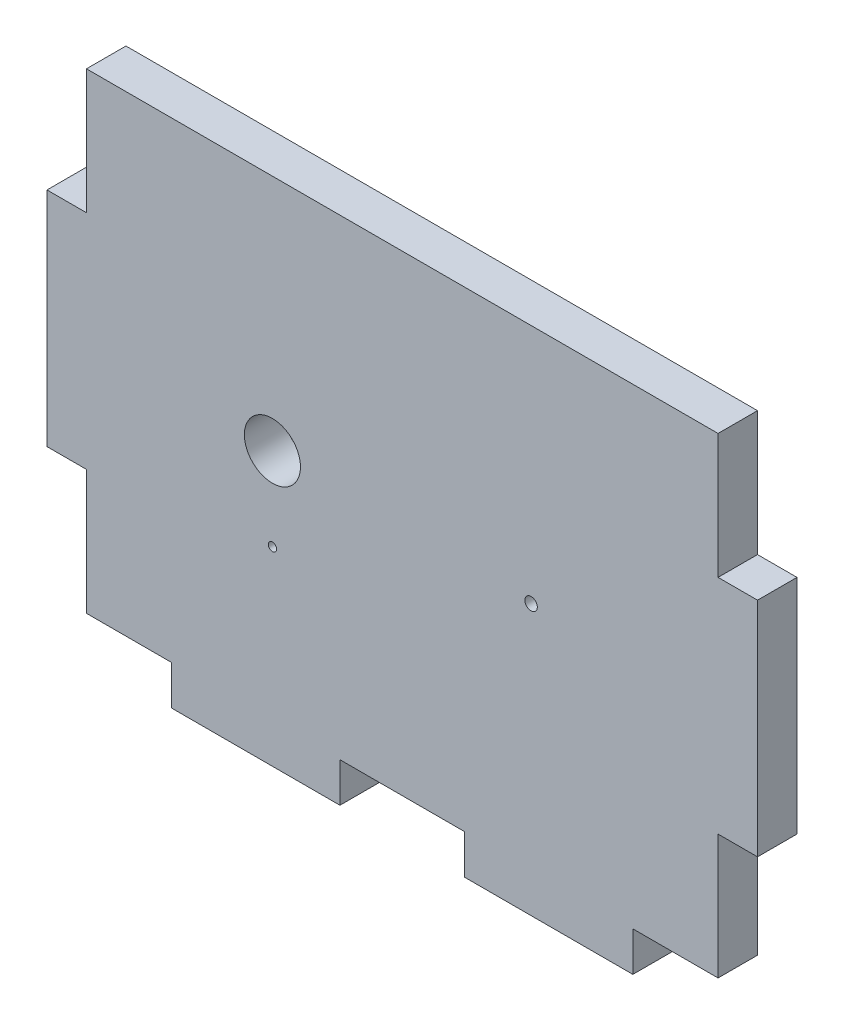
ISO-10303-21;
HEADER;
FILE_DESCRIPTION(('STEP AP214'),'2;1');
FILE_NAME('part.step','',(''),(''),'','','');
FILE_SCHEMA(('AUTOMOTIVE_DESIGN { 1 0 10303 214 1 1 1 1 }'));
ENDSEC;
DATA;
#1=APPLICATION_CONTEXT('core data for automotive mechanical design processes');
#2=APPLICATION_PROTOCOL_DEFINITION('international standard','automotive_design',2000,#1);
#3=PRODUCT_CONTEXT('',#1,'mechanical');
#4=PRODUCT('Part','Part','',(#3));
#5=PRODUCT_RELATED_PRODUCT_CATEGORY('part','',(#4));
#6=PRODUCT_DEFINITION_FORMATION('','',#4);
#7=PRODUCT_DEFINITION_CONTEXT('part definition',#1,'design');
#8=PRODUCT_DEFINITION('design','',#6,#7);
#9=PRODUCT_DEFINITION_SHAPE('','',#8);
#10=(LENGTH_UNIT() NAMED_UNIT(*) SI_UNIT(.MILLI.,.METRE.));
#11=(NAMED_UNIT(*) PLANE_ANGLE_UNIT() SI_UNIT($,.RADIAN.));
#12=(NAMED_UNIT(*) SI_UNIT($,.STERADIAN.) SOLID_ANGLE_UNIT());
#13=UNCERTAINTY_MEASURE_WITH_UNIT(LENGTH_MEASURE(1.E-05),#10,'distance_accuracy_value','');
#14=(GEOMETRIC_REPRESENTATION_CONTEXT(3) GLOBAL_UNCERTAINTY_ASSIGNED_CONTEXT((#13)) GLOBAL_UNIT_ASSIGNED_CONTEXT((#10,
#11,#12)) REPRESENTATION_CONTEXT('',''));
#15=CARTESIAN_POINT('',(0.,0.,0.));
#16=DIRECTION('',(0.,0.,1.));
#17=DIRECTION('',(1.,0.,0.));
#18=AXIS2_PLACEMENT_3D('',#15,#16,#17);
#19=CARTESIAN_POINT('',(-171.,-123.,9.5));
#20=DIRECTION('',(0.,1.,0.));
#21=DIRECTION('',(0.,0.,1.));
#22=AXIS2_PLACEMENT_3D('',#19,#20,#21);
#23=PLANE('',#22);
#24=DIRECTION('',(1.,0.,0.));
#25=VECTOR('',#24,1.);
#26=CARTESIAN_POINT('',(-171.,-123.,9.5));
#27=LINE('',#26,#25);
#28=CARTESIAN_POINT('',(30.0000000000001,-123.,9.5));
#29=VERTEX_POINT('',#28);
#30=CARTESIAN_POINT('',(111.,-123.,9.5));
#31=VERTEX_POINT('',#30);
#32=EDGE_CURVE('E44',#29,#31,#27,.T.);
#33=ORIENTED_EDGE('',*,*,#32,.F.);
#34=DIRECTION('',(0.,0.,1.));
#35=VECTOR('',#34,1.);
#36=CARTESIAN_POINT('',(30.0000000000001,-123.,-9.501));
#37=LINE('',#36,#35);
#38=CARTESIAN_POINT('',(30.0000000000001,-123.,-9.5));
#39=VERTEX_POINT('',#38);
#40=EDGE_CURVE('E263',#39,#29,#37,.T.);
#41=ORIENTED_EDGE('',*,*,#40,.F.);
#42=DIRECTION('',(1.,0.,0.));
#43=VECTOR('',#42,1.);
#44=CARTESIAN_POINT('',(-171.,-123.,-9.5));
#45=LINE('',#44,#43);
#46=CARTESIAN_POINT('',(111.,-123.,-9.5));
#47=VERTEX_POINT('',#46);
#48=EDGE_CURVE('E39',#39,#47,#45,.T.);
#49=ORIENTED_EDGE('',*,*,#48,.T.);
#50=DIRECTION('',(0.,0.,1.));
#51=VECTOR('',#50,1.);
#52=CARTESIAN_POINT('',(111.,-123.,-9.501));
#53=LINE('',#52,#51);
#54=EDGE_CURVE('E288',#47,#31,#53,.T.);
#55=ORIENTED_EDGE('',*,*,#54,.T.);
#56=EDGE_LOOP('',(#33,#41,#49,#55));
#57=FACE_BOUND('',#56,.T.);
#58=ADVANCED_FACE('F35',(#57),#23,.F.);
#59=CARTESIAN_POINT('',(171.,123.,9.5));
#60=DIRECTION('',(-1.,0.,0.));
#61=DIRECTION('',(0.,-1.,0.));
#62=AXIS2_PLACEMENT_3D('',#59,#60,#61);
#63=PLANE('',#62);
#64=DIRECTION('',(0.,1.,0.));
#65=VECTOR('',#64,1.);
#66=CARTESIAN_POINT('',(171.,123.,-9.5));
#67=LINE('',#66,#65);
#68=CARTESIAN_POINT('',(171.,-44.,-9.5));
#69=VERTEX_POINT('',#68);
#70=CARTESIAN_POINT('',(171.,63.0000000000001,-9.5));
#71=VERTEX_POINT('',#70);
#72=EDGE_CURVE('E207',#69,#71,#67,.T.);
#73=ORIENTED_EDGE('',*,*,#72,.T.);
#74=DIRECTION('',(0.,0.,1.));
#75=VECTOR('',#74,1.);
#76=CARTESIAN_POINT('',(171.,63.0000000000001,-9.501));
#77=LINE('',#76,#75);
#78=CARTESIAN_POINT('',(171.,63.0000000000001,9.5));
#79=VERTEX_POINT('',#78);
#80=EDGE_CURVE('E307',#71,#79,#77,.T.);
#81=ORIENTED_EDGE('',*,*,#80,.T.);
#82=DIRECTION('',(0.,1.,0.));
#83=VECTOR('',#82,1.);
#84=CARTESIAN_POINT('',(171.,123.,9.5));
#85=LINE('',#84,#83);
#86=CARTESIAN_POINT('',(171.,-44.,9.5));
#87=VERTEX_POINT('',#86);
#88=EDGE_CURVE('E199',#87,#79,#85,.T.);
#89=ORIENTED_EDGE('',*,*,#88,.F.);
#90=DIRECTION('',(0.,0.,1.));
#91=VECTOR('',#90,1.);
#92=CARTESIAN_POINT('',(171.,-44.,-9.501));
#93=LINE('',#92,#91);
#94=EDGE_CURVE('E318',#69,#87,#93,.T.);
#95=ORIENTED_EDGE('',*,*,#94,.F.);
#96=EDGE_LOOP('',(#73,#81,#89,#95));
#97=FACE_BOUND('',#96,.T.);
#98=ADVANCED_FACE('F37',(#97),#63,.F.);
#99=CARTESIAN_POINT('',(-171.,123.,9.5));
#100=DIRECTION('',(0.,-1.,0.));
#101=DIRECTION('',(0.,0.,-1.));
#102=AXIS2_PLACEMENT_3D('',#99,#100,#101);
#103=PLANE('',#102);
#104=DIRECTION('',(-1.,0.,0.));
#105=VECTOR('',#104,1.);
#106=CARTESIAN_POINT('',(-171.,123.,9.5));
#107=LINE('',#106,#105);
#108=CARTESIAN_POINT('',(152.,123.,9.5));
#109=VERTEX_POINT('',#108);
#110=CARTESIAN_POINT('',(-152.,123.,9.5));
#111=VERTEX_POINT('',#110);
#112=EDGE_CURVE('E192',#109,#111,#107,.T.);
#113=ORIENTED_EDGE('',*,*,#112,.F.);
#114=DIRECTION('',(0.,0.,1.));
#115=VECTOR('',#114,1.);
#116=CARTESIAN_POINT('',(152.,123.,-9.501));
#117=LINE('',#116,#115);
#118=CARTESIAN_POINT('',(152.,123.,-9.5));
#119=VERTEX_POINT('',#118);
#120=EDGE_CURVE('E174',#119,#109,#117,.T.);
#121=ORIENTED_EDGE('',*,*,#120,.F.);
#122=DIRECTION('',(-1.,0.,0.));
#123=VECTOR('',#122,1.);
#124=CARTESIAN_POINT('',(-171.,123.,-9.5));
#125=LINE('',#124,#123);
#126=CARTESIAN_POINT('',(-152.,123.,-9.5));
#127=VERTEX_POINT('',#126);
#128=EDGE_CURVE('E210',#119,#127,#125,.T.);
#129=ORIENTED_EDGE('',*,*,#128,.T.);
#130=DIRECTION('',(0.,0.,1.));
#131=VECTOR('',#130,1.);
#132=CARTESIAN_POINT('',(-152.,123.,-9.501));
#133=LINE('',#132,#131);
#134=EDGE_CURVE('E197',#127,#111,#133,.T.);
#135=ORIENTED_EDGE('',*,*,#134,.T.);
#136=EDGE_LOOP('',(#113,#121,#129,#135));
#137=FACE_BOUND('',#136,.T.);
#138=ADVANCED_FACE('F196',(#137),#103,.F.);
#139=CARTESIAN_POINT('',(-171.,123.,9.5));
#140=DIRECTION('',(1.,0.,0.));
#141=DIRECTION('',(0.,1.,0.));
#142=AXIS2_PLACEMENT_3D('',#139,#140,#141);
#143=PLANE('',#142);
#144=DIRECTION('',(0.,-1.,0.));
#145=VECTOR('',#144,1.);
#146=CARTESIAN_POINT('',(-171.,123.,-9.5));
#147=LINE('',#146,#145);
#148=CARTESIAN_POINT('',(-171.,62.9999999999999,-9.5));
#149=VERTEX_POINT('',#148);
#150=CARTESIAN_POINT('',(-171.,-44.0000000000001,-9.5));
#151=VERTEX_POINT('',#150);
#152=EDGE_CURVE('E212',#149,#151,#147,.T.);
#153=ORIENTED_EDGE('',*,*,#152,.T.);
#154=DIRECTION('',(0.,0.,1.));
#155=VECTOR('',#154,1.);
#156=CARTESIAN_POINT('',(-171.,-44.0000000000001,-9.501));
#157=LINE('',#156,#155);
#158=CARTESIAN_POINT('',(-171.,-44.0000000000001,9.5));
#159=VERTEX_POINT('',#158);
#160=EDGE_CURVE('E347',#151,#159,#157,.T.);
#161=ORIENTED_EDGE('',*,*,#160,.T.);
#162=DIRECTION('',(0.,-1.,0.));
#163=VECTOR('',#162,1.);
#164=CARTESIAN_POINT('',(-171.,123.,9.5));
#165=LINE('',#164,#163);
#166=CARTESIAN_POINT('',(-171.,62.9999999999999,9.5));
#167=VERTEX_POINT('',#166);
#168=EDGE_CURVE('E198',#167,#159,#165,.T.);
#169=ORIENTED_EDGE('',*,*,#168,.F.);
#170=DIRECTION('',(0.,0.,1.));
#171=VECTOR('',#170,1.);
#172=CARTESIAN_POINT('',(-171.,62.9999999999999,-9.501));
#173=LINE('',#172,#171);
#174=EDGE_CURVE('E361',#149,#167,#173,.T.);
#175=ORIENTED_EDGE('',*,*,#174,.F.);
#176=EDGE_LOOP('',(#153,#161,#169,#175));
#177=FACE_BOUND('',#176,.T.);
#178=ADVANCED_FACE('F368',(#177),#143,.F.);
#179=CARTESIAN_POINT('',(-111.,-123.,-9.5));
#180=VERTEX_POINT('',#179);
#181=CARTESIAN_POINT('',(-29.9999999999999,-123.,-9.5));
#182=VERTEX_POINT('',#181);
#183=EDGE_CURVE('E203',#180,#182,#45,.T.);
#184=ORIENTED_EDGE('',*,*,#183,.T.);
#185=DIRECTION('',(0.,0.,1.));
#186=VECTOR('',#185,1.);
#187=CARTESIAN_POINT('',(-29.9999999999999,-123.,-9.501));
#188=LINE('',#187,#186);
#189=CARTESIAN_POINT('',(-29.9999999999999,-123.,9.5));
#190=VERTEX_POINT('',#189);
#191=EDGE_CURVE('E230',#182,#190,#188,.T.);
#192=ORIENTED_EDGE('',*,*,#191,.T.);
#193=CARTESIAN_POINT('',(-111.,-123.,9.5));
#194=VERTEX_POINT('',#193);
#195=EDGE_CURVE('E11',#194,#190,#27,.T.);
#196=ORIENTED_EDGE('',*,*,#195,.F.);
#197=DIRECTION('',(0.,0.,1.));
#198=VECTOR('',#197,1.);
#199=CARTESIAN_POINT('',(-111.,-123.,-9.501));
#200=LINE('',#199,#198);
#201=EDGE_CURVE('E231',#180,#194,#200,.T.);
#202=ORIENTED_EDGE('',*,*,#201,.F.);
#203=EDGE_LOOP('',(#184,#192,#196,#202));
#204=FACE_BOUND('',#203,.T.);
#205=ADVANCED_FACE('F228',(#204),#23,.F.);
#206=CARTESIAN_POINT('',(0.,0.,9.5));
#207=DIRECTION('',(0.,0.,1.));
#208=DIRECTION('',(1.,0.,0.));
#209=AXIS2_PLACEMENT_3D('',#206,#207,#208);
#210=PLANE('',#209);
#211=CARTESIAN_POINT('',(-62.5046863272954,-31.5005831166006,9.5));
#212=DIRECTION('',(0.,0.,1.));
#213=DIRECTION('',(1.,0.,0.));
#214=AXIS2_PLACEMENT_3D('',#211,#212,#213);
#215=CIRCLE('',#214,2.);
#216=CARTESIAN_POINT('',(-60.5046863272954,-31.5005831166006,9.5));
#217=VERTEX_POINT('',#216);
#218=EDGE_CURVE('E581',#217,#217,#215,.T.);
#219=ORIENTED_EDGE('',*,*,#218,.F.);
#220=EDGE_LOOP('',(#219));
#221=FACE_BOUND('',#220,.T.);
#222=CARTESIAN_POINT('',(62.006045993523,7.04573843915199,9.5));
#223=DIRECTION('',(0.,0.,1.));
#224=DIRECTION('',(1.,0.,0.));
#225=AXIS2_PLACEMENT_3D('',#222,#223,#224);
#226=CIRCLE('',#225,3.00000000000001);
#227=CARTESIAN_POINT('',(65.006045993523,7.04573843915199,9.5));
#228=VERTEX_POINT('',#227);
#229=EDGE_CURVE('E585',#228,#228,#226,.T.);
#230=ORIENTED_EDGE('',*,*,#229,.F.);
#231=EDGE_LOOP('',(#230));
#232=FACE_BOUND('',#231,.T.);
#233=CARTESIAN_POINT('',(-62.5046863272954,8.49941688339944,9.5));
#234=DIRECTION('',(0.,0.,1.));
#235=DIRECTION('',(1.,0.,0.));
#236=AXIS2_PLACEMENT_3D('',#233,#234,#235);
#237=CIRCLE('',#236,13.5005831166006);
#238=CARTESIAN_POINT('',(-49.0041032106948,8.49941688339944,9.5));
#239=VERTEX_POINT('',#238);
#240=EDGE_CURVE('E593',#239,#239,#237,.T.);
#241=ORIENTED_EDGE('',*,*,#240,.F.);
#242=EDGE_LOOP('',(#241));
#243=FACE_BOUND('',#242,.T.);
#244=DIRECTION('',(1.,0.,0.));
#245=VECTOR('',#244,1.);
#246=CARTESIAN_POINT('',(171.,63.0000000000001,9.5));
#247=LINE('',#246,#245);
#248=CARTESIAN_POINT('',(152.,63.,9.5));
#249=VERTEX_POINT('',#248);
#250=EDGE_CURVE('E186',#249,#79,#247,.T.);
#251=ORIENTED_EDGE('',*,*,#250,.F.);
#252=DIRECTION('',(0.,-1.,0.));
#253=VECTOR('',#252,1.);
#254=CARTESIAN_POINT('',(152.,63.,9.5));
#255=LINE('',#254,#253);
#256=EDGE_CURVE('E177',#109,#249,#255,.T.);
#257=ORIENTED_EDGE('',*,*,#256,.F.);
#258=ORIENTED_EDGE('',*,*,#112,.T.);
#259=DIRECTION('',(0.,1.,0.));
#260=VECTOR('',#259,1.);
#261=CARTESIAN_POINT('',(-152.,62.9999999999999,9.5));
#262=LINE('',#261,#260);
#263=CARTESIAN_POINT('',(-152.,62.9999999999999,9.5));
#264=VERTEX_POINT('',#263);
#265=EDGE_CURVE('E356',#264,#111,#262,.T.);
#266=ORIENTED_EDGE('',*,*,#265,.F.);
#267=DIRECTION('',(1.,0.,0.));
#268=VECTOR('',#267,1.);
#269=CARTESIAN_POINT('',(-152.,62.9999999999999,9.5));
#270=LINE('',#269,#268);
#271=EDGE_CURVE('E358',#167,#264,#270,.T.);
#272=ORIENTED_EDGE('',*,*,#271,.F.);
#273=ORIENTED_EDGE('',*,*,#168,.T.);
#274=DIRECTION('',(-1.,0.,0.));
#275=VECTOR('',#274,1.);
#276=CARTESIAN_POINT('',(-152.,-44.0000000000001,9.5));
#277=LINE('',#276,#275);
#278=CARTESIAN_POINT('',(-152.,-44.0000000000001,9.5));
#279=VERTEX_POINT('',#278);
#280=EDGE_CURVE('E342',#279,#159,#277,.T.);
#281=ORIENTED_EDGE('',*,*,#280,.F.);
#282=DIRECTION('',(0.,1.,0.));
#283=VECTOR('',#282,1.);
#284=CARTESIAN_POINT('',(-152.,-104.,9.5));
#285=LINE('',#284,#283);
#286=CARTESIAN_POINT('',(-152.,-104.,9.5));
#287=VERTEX_POINT('',#286);
#288=EDGE_CURVE('E338',#287,#279,#285,.T.);
#289=ORIENTED_EDGE('',*,*,#288,.F.);
#290=DIRECTION('',(-1.,0.,0.));
#291=VECTOR('',#290,1.);
#292=CARTESIAN_POINT('',(-111.,-104.,9.5));
#293=LINE('',#292,#291);
#294=CARTESIAN_POINT('',(-111.,-104.,9.5));
#295=VERTEX_POINT('',#294);
#296=EDGE_CURVE('E275',#295,#287,#293,.T.);
#297=ORIENTED_EDGE('',*,*,#296,.F.);
#298=DIRECTION('',(0.,1.,0.));
#299=VECTOR('',#298,1.);
#300=CARTESIAN_POINT('',(-111.,-123.,9.5));
#301=LINE('',#300,#299);
#302=EDGE_CURVE('E272',#194,#295,#301,.T.);
#303=ORIENTED_EDGE('',*,*,#302,.F.);
#304=ORIENTED_EDGE('',*,*,#195,.T.);
#305=DIRECTION('',(0.,-1.,0.));
#306=VECTOR('',#305,1.);
#307=CARTESIAN_POINT('',(-29.9999999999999,-123.,9.5));
#308=LINE('',#307,#306);
#309=CARTESIAN_POINT('',(-29.9999999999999,-104.,9.5));
#310=VERTEX_POINT('',#309);
#311=EDGE_CURVE('E260',#310,#190,#308,.T.);
#312=ORIENTED_EDGE('',*,*,#311,.F.);
#313=DIRECTION('',(-1.,0.,0.));
#314=VECTOR('',#313,1.);
#315=CARTESIAN_POINT('',(30.0000000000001,-104.,9.5));
#316=LINE('',#315,#314);
#317=CARTESIAN_POINT('',(30.0000000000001,-104.,9.5));
#318=VERTEX_POINT('',#317);
#319=EDGE_CURVE('E257',#318,#310,#316,.T.);
#320=ORIENTED_EDGE('',*,*,#319,.F.);
#321=DIRECTION('',(0.,1.,0.));
#322=VECTOR('',#321,1.);
#323=CARTESIAN_POINT('',(30.0000000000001,-123.,9.5));
#324=LINE('',#323,#322);
#325=EDGE_CURVE('E248',#29,#318,#324,.T.);
#326=ORIENTED_EDGE('',*,*,#325,.F.);
#327=ORIENTED_EDGE('',*,*,#32,.T.);
#328=DIRECTION('',(0.,-1.,0.));
#329=VECTOR('',#328,1.);
#330=CARTESIAN_POINT('',(111.,-123.,9.5));
#331=LINE('',#330,#329);
#332=CARTESIAN_POINT('',(111.,-104.,9.5));
#333=VERTEX_POINT('',#332);
#334=EDGE_CURVE('E284',#333,#31,#331,.T.);
#335=ORIENTED_EDGE('',*,*,#334,.F.);
#336=DIRECTION('',(-1.,0.,0.));
#337=VECTOR('',#336,1.);
#338=CARTESIAN_POINT('',(171.,-104.,9.5));
#339=LINE('',#338,#337);
#340=CARTESIAN_POINT('',(152.,-104.,9.5));
#341=VERTEX_POINT('',#340);
#342=EDGE_CURVE('E282',#341,#333,#339,.T.);
#343=ORIENTED_EDGE('',*,*,#342,.F.);
#344=DIRECTION('',(0.,-1.,0.));
#345=VECTOR('',#344,1.);
#346=CARTESIAN_POINT('',(152.,-104.,9.5));
#347=LINE('',#346,#345);
#348=CARTESIAN_POINT('',(152.,-44.,9.5));
#349=VERTEX_POINT('',#348);
#350=EDGE_CURVE('E310',#349,#341,#347,.T.);
#351=ORIENTED_EDGE('',*,*,#350,.F.);
#352=DIRECTION('',(-1.,0.,0.));
#353=VECTOR('',#352,1.);
#354=CARTESIAN_POINT('',(171.,-44.,9.5));
#355=LINE('',#354,#353);
#356=EDGE_CURVE('E306',#87,#349,#355,.T.);
#357=ORIENTED_EDGE('',*,*,#356,.F.);
#358=ORIENTED_EDGE('',*,*,#88,.T.);
#359=EDGE_LOOP('',(#251,#257,#258,#266,#272,#273,#281,#289,#297,#303,#304,#312,#320,#326,#327,
#335,#343,#351,#357,#358));
#360=FACE_BOUND('',#359,.T.);
#361=ADVANCED_FACE('F190',(#221,#232,#243,#360),#210,.T.);
#362=CARTESIAN_POINT('',(0.,0.,-9.5));
#363=DIRECTION('',(0.,0.,1.));
#364=DIRECTION('',(1.,0.,0.));
#365=AXIS2_PLACEMENT_3D('',#362,#363,#364);
#366=PLANE('',#365);
#367=CARTESIAN_POINT('',(-62.5046863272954,-31.5005831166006,-9.5));
#368=DIRECTION('',(0.,0.,1.));
#369=DIRECTION('',(1.,0.,0.));
#370=AXIS2_PLACEMENT_3D('',#367,#368,#369);
#371=CIRCLE('',#370,2.);
#372=CARTESIAN_POINT('',(-60.5046863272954,-31.5005831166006,-9.5));
#373=VERTEX_POINT('',#372);
#374=EDGE_CURVE('E584',#373,#373,#371,.F.);
#375=ORIENTED_EDGE('',*,*,#374,.F.);
#376=EDGE_LOOP('',(#375));
#377=FACE_BOUND('',#376,.T.);
#378=CARTESIAN_POINT('',(62.006045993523,7.04573843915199,-9.5));
#379=DIRECTION('',(0.,0.,1.));
#380=DIRECTION('',(1.,0.,0.));
#381=AXIS2_PLACEMENT_3D('',#378,#379,#380);
#382=CIRCLE('',#381,3.00000000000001);
#383=CARTESIAN_POINT('',(65.006045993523,7.04573843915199,-9.5));
#384=VERTEX_POINT('',#383);
#385=EDGE_CURVE('E588',#384,#384,#382,.F.);
#386=ORIENTED_EDGE('',*,*,#385,.F.);
#387=EDGE_LOOP('',(#386));
#388=FACE_BOUND('',#387,.T.);
#389=CARTESIAN_POINT('',(-62.5046863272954,8.49941688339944,-9.5));
#390=DIRECTION('',(0.,0.,1.));
#391=DIRECTION('',(1.,0.,0.));
#392=AXIS2_PLACEMENT_3D('',#389,#390,#391);
#393=CIRCLE('',#392,13.5005831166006);
#394=CARTESIAN_POINT('',(-49.0041032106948,8.49941688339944,-9.5));
#395=VERTEX_POINT('',#394);
#396=EDGE_CURVE('E354',#395,#395,#393,.F.);
#397=ORIENTED_EDGE('',*,*,#396,.F.);
#398=EDGE_LOOP('',(#397));
#399=FACE_BOUND('',#398,.T.);
#400=DIRECTION('',(0.,1.,0.));
#401=VECTOR('',#400,1.);
#402=CARTESIAN_POINT('',(152.,63.,-9.5));
#403=LINE('',#402,#401);
#404=CARTESIAN_POINT('',(152.,63.,-9.5));
#405=VERTEX_POINT('',#404);
#406=EDGE_CURVE('E180',#405,#119,#403,.T.);
#407=ORIENTED_EDGE('',*,*,#406,.F.);
#408=DIRECTION('',(-1.,0.,0.));
#409=VECTOR('',#408,1.);
#410=CARTESIAN_POINT('',(171.,63.0000000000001,-9.5));
#411=LINE('',#410,#409);
#412=EDGE_CURVE('E52',#71,#405,#411,.T.);
#413=ORIENTED_EDGE('',*,*,#412,.F.);
#414=ORIENTED_EDGE('',*,*,#72,.F.);
#415=DIRECTION('',(1.,0.,0.));
#416=VECTOR('',#415,1.);
#417=CARTESIAN_POINT('',(171.,-44.,-9.5));
#418=LINE('',#417,#416);
#419=CARTESIAN_POINT('',(152.,-44.,-9.5));
#420=VERTEX_POINT('',#419);
#421=EDGE_CURVE('E252',#420,#69,#418,.T.);
#422=ORIENTED_EDGE('',*,*,#421,.F.);
#423=DIRECTION('',(0.,1.,0.));
#424=VECTOR('',#423,1.);
#425=CARTESIAN_POINT('',(152.,-104.,-9.5));
#426=LINE('',#425,#424);
#427=CARTESIAN_POINT('',(152.,-104.,-9.5));
#428=VERTEX_POINT('',#427);
#429=EDGE_CURVE('E303',#428,#420,#426,.T.);
#430=ORIENTED_EDGE('',*,*,#429,.F.);
#431=DIRECTION('',(1.,0.,0.));
#432=VECTOR('',#431,1.);
#433=CARTESIAN_POINT('',(171.,-104.,-9.5));
#434=LINE('',#433,#432);
#435=CARTESIAN_POINT('',(111.,-104.,-9.5));
#436=VERTEX_POINT('',#435);
#437=EDGE_CURVE('E211',#436,#428,#434,.T.);
#438=ORIENTED_EDGE('',*,*,#437,.F.);
#439=DIRECTION('',(0.,1.,0.));
#440=VECTOR('',#439,1.);
#441=CARTESIAN_POINT('',(111.,-123.,-9.5));
#442=LINE('',#441,#440);
#443=EDGE_CURVE('E270',#47,#436,#442,.T.);
#444=ORIENTED_EDGE('',*,*,#443,.F.);
#445=ORIENTED_EDGE('',*,*,#48,.F.);
#446=DIRECTION('',(0.,-1.,0.));
#447=VECTOR('',#446,1.);
#448=CARTESIAN_POINT('',(30.0000000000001,-123.,-9.5));
#449=LINE('',#448,#447);
#450=CARTESIAN_POINT('',(30.0000000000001,-104.,-9.5));
#451=VERTEX_POINT('',#450);
#452=EDGE_CURVE('E245',#451,#39,#449,.T.);
#453=ORIENTED_EDGE('',*,*,#452,.F.);
#454=DIRECTION('',(1.,0.,0.));
#455=VECTOR('',#454,1.);
#456=CARTESIAN_POINT('',(30.0000000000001,-104.,-9.5));
#457=LINE('',#456,#455);
#458=CARTESIAN_POINT('',(-29.9999999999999,-104.,-9.5));
#459=VERTEX_POINT('',#458);
#460=EDGE_CURVE('E242',#459,#451,#457,.T.);
#461=ORIENTED_EDGE('',*,*,#460,.F.);
#462=DIRECTION('',(0.,1.,0.));
#463=VECTOR('',#462,1.);
#464=CARTESIAN_POINT('',(-29.9999999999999,-123.,-9.5));
#465=LINE('',#464,#463);
#466=EDGE_CURVE('E239',#182,#459,#465,.T.);
#467=ORIENTED_EDGE('',*,*,#466,.F.);
#468=ORIENTED_EDGE('',*,*,#183,.F.);
#469=DIRECTION('',(0.,-1.,0.));
#470=VECTOR('',#469,1.);
#471=CARTESIAN_POINT('',(-111.,-123.,-9.5));
#472=LINE('',#471,#470);
#473=CARTESIAN_POINT('',(-111.,-104.,-9.5));
#474=VERTEX_POINT('',#473);
#475=EDGE_CURVE('E237',#474,#180,#472,.T.);
#476=ORIENTED_EDGE('',*,*,#475,.F.);
#477=DIRECTION('',(1.,0.,0.));
#478=VECTOR('',#477,1.);
#479=CARTESIAN_POINT('',(-111.,-104.,-9.5));
#480=LINE('',#479,#478);
#481=CARTESIAN_POINT('',(-152.,-104.,-9.5));
#482=VERTEX_POINT('',#481);
#483=EDGE_CURVE('E246',#482,#474,#480,.T.);
#484=ORIENTED_EDGE('',*,*,#483,.F.);
#485=DIRECTION('',(0.,-1.,0.));
#486=VECTOR('',#485,1.);
#487=CARTESIAN_POINT('',(-152.,-104.,-9.5));
#488=LINE('',#487,#486);
#489=CARTESIAN_POINT('',(-152.,-44.0000000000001,-9.5));
#490=VERTEX_POINT('',#489);
#491=EDGE_CURVE('E336',#490,#482,#488,.T.);
#492=ORIENTED_EDGE('',*,*,#491,.F.);
#493=DIRECTION('',(1.,0.,0.));
#494=VECTOR('',#493,1.);
#495=CARTESIAN_POINT('',(-152.,-44.0000000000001,-9.5));
#496=LINE('',#495,#494);
#497=EDGE_CURVE('E330',#151,#490,#496,.T.);
#498=ORIENTED_EDGE('',*,*,#497,.F.);
#499=ORIENTED_EDGE('',*,*,#152,.F.);
#500=DIRECTION('',(-1.,0.,0.));
#501=VECTOR('',#500,1.);
#502=CARTESIAN_POINT('',(-152.,62.9999999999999,-9.5));
#503=LINE('',#502,#501);
#504=CARTESIAN_POINT('',(-152.,62.9999999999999,-9.5));
#505=VERTEX_POINT('',#504);
#506=EDGE_CURVE('E352',#505,#149,#503,.T.);
#507=ORIENTED_EDGE('',*,*,#506,.F.);
#508=DIRECTION('',(0.,-1.,0.));
#509=VECTOR('',#508,1.);
#510=CARTESIAN_POINT('',(-152.,62.9999999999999,-9.5));
#511=LINE('',#510,#509);
#512=EDGE_CURVE('E60',#127,#505,#511,.T.);
#513=ORIENTED_EDGE('',*,*,#512,.F.);
#514=ORIENTED_EDGE('',*,*,#128,.F.);
#515=EDGE_LOOP('',(#407,#413,#414,#422,#430,#438,#444,#445,#453,#461,#467,#468,#476,#484,#492,
#498,#499,#507,#513,#514));
#516=FACE_BOUND('',#515,.T.);
#517=ADVANCED_FACE('F235',(#377,#388,#399,#516),#366,.F.);
#518=CARTESIAN_POINT('',(111.,-123.,-9.501));
#519=DIRECTION('',(-1.,0.,0.));
#520=DIRECTION('',(0.,0.,1.));
#521=AXIS2_PLACEMENT_3D('',#518,#519,#520);
#522=PLANE('',#521);
#523=ORIENTED_EDGE('',*,*,#443,.T.);
#524=DIRECTION('',(0.,0.,1.));
#525=VECTOR('',#524,1.);
#526=CARTESIAN_POINT('',(111.,-104.,-9.501));
#527=LINE('',#526,#525);
#528=EDGE_CURVE('E287',#436,#333,#527,.T.);
#529=ORIENTED_EDGE('',*,*,#528,.T.);
#530=ORIENTED_EDGE('',*,*,#334,.T.);
#531=ORIENTED_EDGE('',*,*,#54,.F.);
#532=EDGE_LOOP('',(#523,#529,#530,#531));
#533=FACE_BOUND('',#532,.T.);
#534=ADVANCED_FACE('F393',(#533),#522,.F.);
#535=CARTESIAN_POINT('',(171.,-104.,-9.501));
#536=DIRECTION('',(0.,1.,0.));
#537=DIRECTION('',(-1.,0.,0.));
#538=AXIS2_PLACEMENT_3D('',#535,#536,#537);
#539=PLANE('',#538);
#540=ORIENTED_EDGE('',*,*,#437,.T.);
#541=DIRECTION('',(0.,0.,1.));
#542=VECTOR('',#541,1.);
#543=CARTESIAN_POINT('',(152.,-104.,-9.501));
#544=LINE('',#543,#542);
#545=EDGE_CURVE('E297',#428,#341,#544,.T.);
#546=ORIENTED_EDGE('',*,*,#545,.T.);
#547=ORIENTED_EDGE('',*,*,#342,.T.);
#548=ORIENTED_EDGE('',*,*,#528,.F.);
#549=EDGE_LOOP('',(#540,#546,#547,#548));
#550=FACE_BOUND('',#549,.T.);
#551=ADVANCED_FACE('F296',(#550),#539,.F.);
#552=CARTESIAN_POINT('',(-111.,-123.,-9.501));
#553=DIRECTION('',(1.,0.,0.));
#554=DIRECTION('',(0.,0.,-1.));
#555=AXIS2_PLACEMENT_3D('',#552,#553,#554);
#556=PLANE('',#555);
#557=ORIENTED_EDGE('',*,*,#475,.T.);
#558=ORIENTED_EDGE('',*,*,#201,.T.);
#559=ORIENTED_EDGE('',*,*,#302,.T.);
#560=DIRECTION('',(0.,0.,1.));
#561=VECTOR('',#560,1.);
#562=CARTESIAN_POINT('',(-111.,-104.,-9.501));
#563=LINE('',#562,#561);
#564=EDGE_CURVE('E278',#474,#295,#563,.T.);
#565=ORIENTED_EDGE('',*,*,#564,.F.);
#566=EDGE_LOOP('',(#557,#558,#559,#565));
#567=FACE_BOUND('',#566,.T.);
#568=ADVANCED_FACE('F384',(#567),#556,.F.);
#569=CARTESIAN_POINT('',(-111.,-104.,-9.501));
#570=DIRECTION('',(0.,1.,0.));
#571=DIRECTION('',(-1.,0.,0.));
#572=AXIS2_PLACEMENT_3D('',#569,#570,#571);
#573=PLANE('',#572);
#574=ORIENTED_EDGE('',*,*,#296,.T.);
#575=DIRECTION('',(0.,0.,1.));
#576=VECTOR('',#575,1.);
#577=CARTESIAN_POINT('',(-152.,-104.,-9.501));
#578=LINE('',#577,#576);
#579=EDGE_CURVE('E345',#482,#287,#578,.T.);
#580=ORIENTED_EDGE('',*,*,#579,.F.);
#581=ORIENTED_EDGE('',*,*,#483,.T.);
#582=ORIENTED_EDGE('',*,*,#564,.T.);
#583=EDGE_LOOP('',(#574,#580,#581,#582));
#584=FACE_BOUND('',#583,.T.);
#585=ADVANCED_FACE('F378',(#584),#573,.F.);
#586=CARTESIAN_POINT('',(30.0000000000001,-123.,-9.501));
#587=DIRECTION('',(1.,0.,0.));
#588=DIRECTION('',(0.,0.,-1.));
#589=AXIS2_PLACEMENT_3D('',#586,#587,#588);
#590=PLANE('',#589);
#591=ORIENTED_EDGE('',*,*,#452,.T.);
#592=ORIENTED_EDGE('',*,*,#40,.T.);
#593=ORIENTED_EDGE('',*,*,#325,.T.);
#594=DIRECTION('',(0.,0.,1.));
#595=VECTOR('',#594,1.);
#596=CARTESIAN_POINT('',(30.0000000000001,-104.,-9.501));
#597=LINE('',#596,#595);
#598=EDGE_CURVE('E262',#451,#318,#597,.T.);
#599=ORIENTED_EDGE('',*,*,#598,.F.);
#600=EDGE_LOOP('',(#591,#592,#593,#599));
#601=FACE_BOUND('',#600,.T.);
#602=ADVANCED_FACE('F391',(#601),#590,.F.);
#603=CARTESIAN_POINT('',(-29.9999999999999,-123.,-9.501));
#604=DIRECTION('',(-1.,0.,0.));
#605=DIRECTION('',(0.,0.,1.));
#606=AXIS2_PLACEMENT_3D('',#603,#604,#605);
#607=PLANE('',#606);
#608=ORIENTED_EDGE('',*,*,#466,.T.);
#609=DIRECTION('',(0.,0.,1.));
#610=VECTOR('',#609,1.);
#611=CARTESIAN_POINT('',(-29.9999999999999,-104.,-9.501));
#612=LINE('',#611,#610);
#613=EDGE_CURVE('E266',#459,#310,#612,.T.);
#614=ORIENTED_EDGE('',*,*,#613,.T.);
#615=ORIENTED_EDGE('',*,*,#311,.T.);
#616=ORIENTED_EDGE('',*,*,#191,.F.);
#617=EDGE_LOOP('',(#608,#614,#615,#616));
#618=FACE_BOUND('',#617,.T.);
#619=ADVANCED_FACE('F457',(#618),#607,.F.);
#620=CARTESIAN_POINT('',(30.0000000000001,-104.,-9.501));
#621=DIRECTION('',(0.,1.,0.));
#622=DIRECTION('',(-1.,0.,0.));
#623=AXIS2_PLACEMENT_3D('',#620,#621,#622);
#624=PLANE('',#623);
#625=ORIENTED_EDGE('',*,*,#460,.T.);
#626=ORIENTED_EDGE('',*,*,#598,.T.);
#627=ORIENTED_EDGE('',*,*,#319,.T.);
#628=ORIENTED_EDGE('',*,*,#613,.F.);
#629=EDGE_LOOP('',(#625,#626,#627,#628));
#630=FACE_BOUND('',#629,.T.);
#631=ADVANCED_FACE('F440',(#630),#624,.F.);
#632=CARTESIAN_POINT('',(152.,-104.,-9.501));
#633=DIRECTION('',(-1.,0.,0.));
#634=DIRECTION('',(0.,0.,1.));
#635=AXIS2_PLACEMENT_3D('',#632,#633,#634);
#636=PLANE('',#635);
#637=ORIENTED_EDGE('',*,*,#429,.T.);
#638=DIRECTION('',(0.,0.,1.));
#639=VECTOR('',#638,1.);
#640=CARTESIAN_POINT('',(152.,-44.,-9.501));
#641=LINE('',#640,#639);
#642=EDGE_CURVE('E320',#420,#349,#641,.T.);
#643=ORIENTED_EDGE('',*,*,#642,.T.);
#644=ORIENTED_EDGE('',*,*,#350,.T.);
#645=ORIENTED_EDGE('',*,*,#545,.F.);
#646=EDGE_LOOP('',(#637,#643,#644,#645));
#647=FACE_BOUND('',#646,.T.);
#648=ADVANCED_FACE('F429',(#647),#636,.F.);
#649=CARTESIAN_POINT('',(171.,-44.,-9.501));
#650=DIRECTION('',(0.,1.,0.));
#651=DIRECTION('',(-1.,0.,0.));
#652=AXIS2_PLACEMENT_3D('',#649,#650,#651);
#653=PLANE('',#652);
#654=ORIENTED_EDGE('',*,*,#421,.T.);
#655=ORIENTED_EDGE('',*,*,#94,.T.);
#656=ORIENTED_EDGE('',*,*,#356,.T.);
#657=ORIENTED_EDGE('',*,*,#642,.F.);
#658=EDGE_LOOP('',(#654,#655,#656,#657));
#659=FACE_BOUND('',#658,.T.);
#660=ADVANCED_FACE('F324',(#659),#653,.F.);
#661=CARTESIAN_POINT('',(-152.,-104.,-9.501));
#662=DIRECTION('',(1.,0.,0.));
#663=DIRECTION('',(0.,0.,-1.));
#664=AXIS2_PLACEMENT_3D('',#661,#662,#663);
#665=PLANE('',#664);
#666=ORIENTED_EDGE('',*,*,#491,.T.);
#667=ORIENTED_EDGE('',*,*,#579,.T.);
#668=ORIENTED_EDGE('',*,*,#288,.T.);
#669=DIRECTION('',(0.,0.,1.));
#670=VECTOR('',#669,1.);
#671=CARTESIAN_POINT('',(-152.,-44.0000000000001,-9.501));
#672=LINE('',#671,#670);
#673=EDGE_CURVE('E344',#490,#279,#672,.T.);
#674=ORIENTED_EDGE('',*,*,#673,.F.);
#675=EDGE_LOOP('',(#666,#667,#668,#674));
#676=FACE_BOUND('',#675,.T.);
#677=ADVANCED_FACE('F375',(#676),#665,.F.);
#678=CARTESIAN_POINT('',(-152.,-44.0000000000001,-9.501));
#679=DIRECTION('',(0.,1.,0.));
#680=DIRECTION('',(-1.,0.,0.));
#681=AXIS2_PLACEMENT_3D('',#678,#679,#680);
#682=PLANE('',#681);
#683=ORIENTED_EDGE('',*,*,#497,.T.);
#684=ORIENTED_EDGE('',*,*,#673,.T.);
#685=ORIENTED_EDGE('',*,*,#280,.T.);
#686=ORIENTED_EDGE('',*,*,#160,.F.);
#687=EDGE_LOOP('',(#683,#684,#685,#686));
#688=FACE_BOUND('',#687,.T.);
#689=ADVANCED_FACE('F371',(#688),#682,.F.);
#690=CARTESIAN_POINT('',(-152.,62.9999999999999,-9.501));
#691=DIRECTION('',(1.,0.,0.));
#692=DIRECTION('',(0.,0.,-1.));
#693=AXIS2_PLACEMENT_3D('',#690,#691,#692);
#694=PLANE('',#693);
#695=ORIENTED_EDGE('',*,*,#512,.T.);
#696=DIRECTION('',(0.,0.,1.));
#697=VECTOR('',#696,1.);
#698=CARTESIAN_POINT('',(-152.,62.9999999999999,-9.501));
#699=LINE('',#698,#697);
#700=EDGE_CURVE('E339',#505,#264,#699,.T.);
#701=ORIENTED_EDGE('',*,*,#700,.T.);
#702=ORIENTED_EDGE('',*,*,#265,.T.);
#703=ORIENTED_EDGE('',*,*,#134,.F.);
#704=EDGE_LOOP('',(#695,#701,#702,#703));
#705=FACE_BOUND('',#704,.T.);
#706=ADVANCED_FACE('F502',(#705),#694,.F.);
#707=CARTESIAN_POINT('',(-152.,62.9999999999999,-9.501));
#708=DIRECTION('',(0.,-1.,0.));
#709=DIRECTION('',(1.,0.,0.));
#710=AXIS2_PLACEMENT_3D('',#707,#708,#709);
#711=PLANE('',#710);
#712=ORIENTED_EDGE('',*,*,#506,.T.);
#713=ORIENTED_EDGE('',*,*,#174,.T.);
#714=ORIENTED_EDGE('',*,*,#271,.T.);
#715=ORIENTED_EDGE('',*,*,#700,.F.);
#716=EDGE_LOOP('',(#712,#713,#714,#715));
#717=FACE_BOUND('',#716,.T.);
#718=ADVANCED_FACE('F364',(#717),#711,.F.);
#719=CARTESIAN_POINT('',(171.,63.0000000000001,-9.501));
#720=DIRECTION('',(0.,-1.,0.));
#721=DIRECTION('',(1.,0.,0.));
#722=AXIS2_PLACEMENT_3D('',#719,#720,#721);
#723=PLANE('',#722);
#724=ORIENTED_EDGE('',*,*,#412,.T.);
#725=DIRECTION('',(0.,0.,1.));
#726=VECTOR('',#725,1.);
#727=CARTESIAN_POINT('',(152.,63.,-9.501));
#728=LINE('',#727,#726);
#729=EDGE_CURVE('E185',#405,#249,#728,.T.);
#730=ORIENTED_EDGE('',*,*,#729,.T.);
#731=ORIENTED_EDGE('',*,*,#250,.T.);
#732=ORIENTED_EDGE('',*,*,#80,.F.);
#733=EDGE_LOOP('',(#724,#730,#731,#732));
#734=FACE_BOUND('',#733,.T.);
#735=ADVANCED_FACE('F328',(#734),#723,.F.);
#736=CARTESIAN_POINT('',(152.,63.,-9.501));
#737=DIRECTION('',(-1.,0.,0.));
#738=DIRECTION('',(0.,0.,1.));
#739=AXIS2_PLACEMENT_3D('',#736,#737,#738);
#740=PLANE('',#739);
#741=ORIENTED_EDGE('',*,*,#406,.T.);
#742=ORIENTED_EDGE('',*,*,#120,.T.);
#743=ORIENTED_EDGE('',*,*,#256,.T.);
#744=ORIENTED_EDGE('',*,*,#729,.F.);
#745=EDGE_LOOP('',(#741,#742,#743,#744));
#746=FACE_BOUND('',#745,.T.);
#747=ADVANCED_FACE('F176',(#746),#740,.F.);
#748=CARTESIAN_POINT('',(-62.5046863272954,8.49941688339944,-9.501));
#749=DIRECTION('',(0.,0.,1.));
#750=DIRECTION('',(1.,0.,0.));
#751=AXIS2_PLACEMENT_3D('',#748,#749,#750);
#752=CYLINDRICAL_SURFACE('',#751,13.5005831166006);
#753=ORIENTED_EDGE('',*,*,#240,.T.);
#754=EDGE_LOOP('',(#753));
#755=FACE_BOUND('',#754,.T.);
#756=ORIENTED_EDGE('',*,*,#396,.T.);
#757=EDGE_LOOP('',(#756));
#758=FACE_BOUND('',#757,.T.);
#759=ADVANCED_FACE('F534',(#755,#758),#752,.F.);
#760=CARTESIAN_POINT('',(62.006045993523,7.04573843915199,-9.501));
#761=DIRECTION('',(0.,0.,1.));
#762=DIRECTION('',(1.,0.,0.));
#763=AXIS2_PLACEMENT_3D('',#760,#761,#762);
#764=CYLINDRICAL_SURFACE('',#763,3.00000000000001);
#765=ORIENTED_EDGE('',*,*,#229,.T.);
#766=EDGE_LOOP('',(#765));
#767=FACE_BOUND('',#766,.T.);
#768=ORIENTED_EDGE('',*,*,#385,.T.);
#769=EDGE_LOOP('',(#768));
#770=FACE_BOUND('',#769,.T.);
#771=ADVANCED_FACE('F554',(#767,#770),#764,.F.);
#772=CARTESIAN_POINT('',(-62.5046863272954,-31.5005831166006,-9.501));
#773=DIRECTION('',(0.,0.,1.));
#774=DIRECTION('',(1.,0.,0.));
#775=AXIS2_PLACEMENT_3D('',#772,#773,#774);
#776=CYLINDRICAL_SURFACE('',#775,2.);
#777=ORIENTED_EDGE('',*,*,#218,.T.);
#778=EDGE_LOOP('',(#777));
#779=FACE_BOUND('',#778,.T.);
#780=ORIENTED_EDGE('',*,*,#374,.T.);
#781=EDGE_LOOP('',(#780));
#782=FACE_BOUND('',#781,.T.);
#783=ADVANCED_FACE('F564',(#779,#782),#776,.F.);
#784=CLOSED_SHELL('',(#58,#98,#138,#178,#205,#361,#517,#534,#551,#568,#585,#602,#619,#631,#648,
#660,#677,#689,#706,#718,#735,#747,#759,#771,#783));
#785=MANIFOLD_SOLID_BREP('B2',#784);
#786=ADVANCED_BREP_SHAPE_REPRESENTATION('',(#18,#785),#14);
#787=SHAPE_DEFINITION_REPRESENTATION(#9,#786);
ENDSEC;
END-ISO-10303-21;
